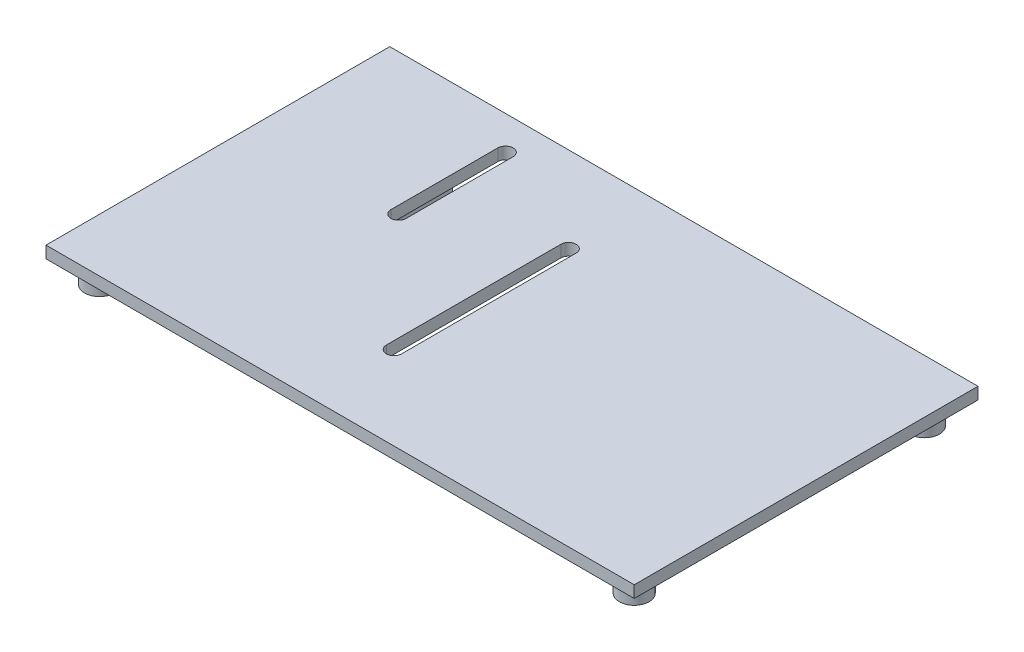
ISO-10303-21;
HEADER;
FILE_DESCRIPTION(('STEP AP214'),'2;1');
FILE_NAME('part.step','',(''),(''),'','','');
FILE_SCHEMA(('AUTOMOTIVE_DESIGN { 1 0 10303 214 1 1 1 1 }'));
ENDSEC;
DATA;
#1=APPLICATION_CONTEXT('core data for automotive mechanical design processes');
#2=APPLICATION_PROTOCOL_DEFINITION('international standard','automotive_design',2000,#1);
#3=PRODUCT_CONTEXT('',#1,'mechanical');
#4=PRODUCT('Part','Part','',(#3));
#5=PRODUCT_RELATED_PRODUCT_CATEGORY('part','',(#4));
#6=PRODUCT_DEFINITION_FORMATION('','',#4);
#7=PRODUCT_DEFINITION_CONTEXT('part definition',#1,'design');
#8=PRODUCT_DEFINITION('design','',#6,#7);
#9=PRODUCT_DEFINITION_SHAPE('','',#8);
#10=(LENGTH_UNIT() NAMED_UNIT(*) SI_UNIT(.MILLI.,.METRE.));
#11=(NAMED_UNIT(*) PLANE_ANGLE_UNIT() SI_UNIT($,.RADIAN.));
#12=(NAMED_UNIT(*) SI_UNIT($,.STERADIAN.) SOLID_ANGLE_UNIT());
#13=UNCERTAINTY_MEASURE_WITH_UNIT(LENGTH_MEASURE(1.E-05),#10,'distance_accuracy_value','');
#14=(GEOMETRIC_REPRESENTATION_CONTEXT(3) GLOBAL_UNCERTAINTY_ASSIGNED_CONTEXT((#13)) GLOBAL_UNIT_ASSIGNED_CONTEXT((#10,
#11,#12)) REPRESENTATION_CONTEXT('',''));
#15=CARTESIAN_POINT('',(0.,0.,0.));
#16=DIRECTION('',(0.,0.,1.));
#17=DIRECTION('',(1.,0.,0.));
#18=AXIS2_PLACEMENT_3D('',#15,#16,#17);
#19=CARTESIAN_POINT('',(0.,0.,0.));
#20=DIRECTION('',(0.,-1.,0.));
#21=DIRECTION('',(0.,0.,-1.));
#22=AXIS2_PLACEMENT_3D('',#19,#20,#21);
#23=PLANE('',#22);
#24=CARTESIAN_POINT('',(-3.9,0.,11.55));
#25=DIRECTION('',(0.,-1.,0.));
#26=DIRECTION('',(0.,0.,-1.));
#27=AXIS2_PLACEMENT_3D('',#24,#25,#26);
#28=CIRCLE('',#27,0.999999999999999);
#29=CARTESIAN_POINT('',(-2.9,0.,11.55));
#30=VERTEX_POINT('',#29);
#31=CARTESIAN_POINT('',(-4.89999999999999,0.,11.55));
#32=VERTEX_POINT('',#31);
#33=EDGE_CURVE('E50',#30,#32,#28,.T.);
#34=ORIENTED_EDGE('',*,*,#33,.F.);
#35=DIRECTION('',(0.,0.,1.));
#36=VECTOR('',#35,1.);
#37=CARTESIAN_POINT('',(-2.9,0.,11.55));
#38=LINE('',#37,#36);
#39=CARTESIAN_POINT('',(-2.89999999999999,0.,-11.3));
#40=VERTEX_POINT('',#39);
#41=EDGE_CURVE('E243',#40,#30,#38,.T.);
#42=ORIENTED_EDGE('',*,*,#41,.F.);
#43=CARTESIAN_POINT('',(-3.89999999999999,0.,-11.3));
#44=DIRECTION('',(0.,-1.,0.));
#45=DIRECTION('',(0.,0.,-1.));
#46=AXIS2_PLACEMENT_3D('',#43,#44,#45);
#47=CIRCLE('',#46,0.999999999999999);
#48=CARTESIAN_POINT('',(-4.89999999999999,0.,-11.3));
#49=VERTEX_POINT('',#48);
#50=EDGE_CURVE('E255',#49,#40,#47,.T.);
#51=ORIENTED_EDGE('',*,*,#50,.F.);
#52=DIRECTION('',(0.,0.,-1.));
#53=VECTOR('',#52,1.);
#54=CARTESIAN_POINT('',(-4.89999999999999,0.,11.55));
#55=LINE('',#54,#53);
#56=EDGE_CURVE('E252',#32,#49,#55,.T.);
#57=ORIENTED_EDGE('',*,*,#56,.F.);
#58=EDGE_LOOP('',(#34,#42,#51,#57));
#59=FACE_BOUND('',#58,.T.);
#60=CARTESIAN_POINT('',(-18.95,0.,-4.1));
#61=DIRECTION('',(0.,-1.,0.));
#62=DIRECTION('',(0.,0.,-1.));
#63=AXIS2_PLACEMENT_3D('',#60,#61,#62);
#64=CIRCLE('',#63,0.999999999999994);
#65=CARTESIAN_POINT('',(-17.95,0.,-4.1));
#66=VERTEX_POINT('',#65);
#67=CARTESIAN_POINT('',(-19.95,0.,-4.1));
#68=VERTEX_POINT('',#67);
#69=EDGE_CURVE('E262',#66,#68,#64,.T.);
#70=ORIENTED_EDGE('',*,*,#69,.F.);
#71=DIRECTION('',(0.,0.,1.));
#72=VECTOR('',#71,1.);
#73=CARTESIAN_POINT('',(-17.95,0.,-4.1));
#74=LINE('',#73,#72);
#75=CARTESIAN_POINT('',(-17.95,0.,-18.1));
#76=VERTEX_POINT('',#75);
#77=EDGE_CURVE('E272',#76,#66,#74,.T.);
#78=ORIENTED_EDGE('',*,*,#77,.F.);
#79=CARTESIAN_POINT('',(-18.95,0.,-18.1));
#80=DIRECTION('',(0.,-1.,0.));
#81=DIRECTION('',(0.,0.,-1.));
#82=AXIS2_PLACEMENT_3D('',#79,#80,#81);
#83=CIRCLE('',#82,0.999999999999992);
#84=CARTESIAN_POINT('',(-19.95,0.,-18.1));
#85=VERTEX_POINT('',#84);
#86=EDGE_CURVE('E286',#85,#76,#83,.T.);
#87=ORIENTED_EDGE('',*,*,#86,.F.);
#88=DIRECTION('',(0.,0.,-1.));
#89=VECTOR('',#88,1.);
#90=CARTESIAN_POINT('',(-19.95,0.,-4.1));
#91=LINE('',#90,#89);
#92=EDGE_CURVE('E283',#68,#85,#91,.T.);
#93=ORIENTED_EDGE('',*,*,#92,.F.);
#94=EDGE_LOOP('',(#70,#78,#87,#93));
#95=FACE_BOUND('',#94,.T.);
#96=CARTESIAN_POINT('',(35.,0.,-19.));
#97=DIRECTION('',(0.,-1.,0.));
#98=DIRECTION('',(0.,0.,-1.));
#99=AXIS2_PLACEMENT_3D('',#96,#97,#98);
#100=CIRCLE('',#99,3.);
#101=CARTESIAN_POINT('',(35.,0.,-22.));
#102=VERTEX_POINT('',#101);
#103=EDGE_CURVE('E408',#102,#102,#100,.T.);
#104=ORIENTED_EDGE('',*,*,#103,.F.);
#105=EDGE_LOOP('',(#104));
#106=FACE_BOUND('',#105,.T.);
#107=CARTESIAN_POINT('',(-35.,0.,-19.));
#108=DIRECTION('',(0.,-1.,0.));
#109=DIRECTION('',(0.,0.,-1.));
#110=AXIS2_PLACEMENT_3D('',#107,#108,#109);
#111=CIRCLE('',#110,3.);
#112=CARTESIAN_POINT('',(-35.,0.,-22.));
#113=VERTEX_POINT('',#112);
#114=EDGE_CURVE('E414',#113,#113,#111,.T.);
#115=ORIENTED_EDGE('',*,*,#114,.F.);
#116=EDGE_LOOP('',(#115));
#117=FACE_BOUND('',#116,.T.);
#118=CARTESIAN_POINT('',(35.,0.,19.));
#119=DIRECTION('',(0.,-1.,0.));
#120=DIRECTION('',(0.,0.,-1.));
#121=AXIS2_PLACEMENT_3D('',#118,#119,#120);
#122=CIRCLE('',#121,3.);
#123=CARTESIAN_POINT('',(35.,0.,16.));
#124=VERTEX_POINT('',#123);
#125=EDGE_CURVE('E420',#124,#124,#122,.T.);
#126=ORIENTED_EDGE('',*,*,#125,.F.);
#127=EDGE_LOOP('',(#126));
#128=FACE_BOUND('',#127,.T.);
#129=CARTESIAN_POINT('',(-35.,0.,19.));
#130=DIRECTION('',(0.,-1.,0.));
#131=DIRECTION('',(0.,0.,-1.));
#132=AXIS2_PLACEMENT_3D('',#129,#130,#131);
#133=CIRCLE('',#132,3.);
#134=CARTESIAN_POINT('',(-35.,0.,16.));
#135=VERTEX_POINT('',#134);
#136=EDGE_CURVE('E426',#135,#135,#133,.T.);
#137=ORIENTED_EDGE('',*,*,#136,.F.);
#138=EDGE_LOOP('',(#137));
#139=FACE_BOUND('',#138,.T.);
#140=DIRECTION('',(0.,0.,-1.));
#141=VECTOR('',#140,1.);
#142=CARTESIAN_POINT('',(38.5,0.,22.5));
#143=LINE('',#142,#141);
#144=CARTESIAN_POINT('',(38.5,0.,22.5));
#145=VERTEX_POINT('',#144);
#146=CARTESIAN_POINT('',(38.5,0.,-22.5));
#147=VERTEX_POINT('',#146);
#148=EDGE_CURVE('E432',#145,#147,#143,.T.);
#149=ORIENTED_EDGE('',*,*,#148,.F.);
#150=DIRECTION('',(1.,0.,0.));
#151=VECTOR('',#150,1.);
#152=CARTESIAN_POINT('',(-38.5,0.,22.5));
#153=LINE('',#152,#151);
#154=CARTESIAN_POINT('',(-38.5,0.,22.5));
#155=VERTEX_POINT('',#154);
#156=EDGE_CURVE('E439',#155,#145,#153,.T.);
#157=ORIENTED_EDGE('',*,*,#156,.F.);
#158=DIRECTION('',(0.,0.,1.));
#159=VECTOR('',#158,1.);
#160=CARTESIAN_POINT('',(-38.5,0.,22.5));
#161=LINE('',#160,#159);
#162=CARTESIAN_POINT('',(-38.5,0.,-22.5));
#163=VERTEX_POINT('',#162);
#164=EDGE_CURVE('E450',#163,#155,#161,.T.);
#165=ORIENTED_EDGE('',*,*,#164,.F.);
#166=DIRECTION('',(-1.,0.,0.));
#167=VECTOR('',#166,1.);
#168=CARTESIAN_POINT('',(-38.5,0.,-22.5));
#169=LINE('',#168,#167);
#170=EDGE_CURVE('E448',#147,#163,#169,.T.);
#171=ORIENTED_EDGE('',*,*,#170,.F.);
#172=EDGE_LOOP('',(#149,#157,#165,#171));
#173=FACE_BOUND('',#172,.T.);
#174=DIRECTION('',(1.,0.,0.));
#175=VECTOR('',#174,1.);
#176=CARTESIAN_POINT('',(-25.,0.,-12.5));
#177=LINE('',#176,#175);
#178=CARTESIAN_POINT('',(-25.,0.,-12.5));
#179=VERTEX_POINT('',#178);
#180=CARTESIAN_POINT('',(-20.3,0.,-12.5));
#181=VERTEX_POINT('',#180);
#182=EDGE_CURVE('E371',#179,#181,#177,.T.);
#183=ORIENTED_EDGE('',*,*,#182,.F.);
#184=DIRECTION('',(0.,0.,-1.));
#185=VECTOR('',#184,1.);
#186=CARTESIAN_POINT('',(-25.,0.,13.));
#187=LINE('',#186,#185);
#188=CARTESIAN_POINT('',(-25.,0.,13.));
#189=VERTEX_POINT('',#188);
#190=EDGE_CURVE('E357',#189,#179,#187,.T.);
#191=ORIENTED_EDGE('',*,*,#190,.F.);
#192=DIRECTION('',(-1.,0.,0.));
#193=VECTOR('',#192,1.);
#194=CARTESIAN_POINT('',(-25.,0.,13.));
#195=LINE('',#194,#193);
#196=CARTESIAN_POINT('',(-20.3,0.,13.));
#197=VERTEX_POINT('',#196);
#198=EDGE_CURVE('E362',#197,#189,#195,.T.);
#199=ORIENTED_EDGE('',*,*,#198,.F.);
#200=DIRECTION('',(0.,0.,1.));
#201=VECTOR('',#200,1.);
#202=CARTESIAN_POINT('',(-20.3,0.,13.));
#203=LINE('',#202,#201);
#204=EDGE_CURVE('E373',#181,#197,#203,.T.);
#205=ORIENTED_EDGE('',*,*,#204,.F.);
#206=EDGE_LOOP('',(#183,#191,#199,#205));
#207=FACE_BOUND('',#206,.T.);
#208=DIRECTION('',(1.,0.,0.));
#209=VECTOR('',#208,1.);
#210=CARTESIAN_POINT('',(12.25,0.,-19.65));
#211=LINE('',#210,#209);
#212=CARTESIAN_POINT('',(12.25,0.,-19.65));
#213=VERTEX_POINT('',#212);
#214=CARTESIAN_POINT('',(17.,0.,-19.65));
#215=VERTEX_POINT('',#214);
#216=EDGE_CURVE('E342',#213,#215,#211,.T.);
#217=ORIENTED_EDGE('',*,*,#216,.F.);
#218=DIRECTION('',(0.,0.,-1.));
#219=VECTOR('',#218,1.);
#220=CARTESIAN_POINT('',(12.25,0.,-12.6));
#221=LINE('',#220,#219);
#222=CARTESIAN_POINT('',(12.25,0.,-12.6));
#223=VERTEX_POINT('',#222);
#224=EDGE_CURVE('E328',#223,#213,#221,.T.);
#225=ORIENTED_EDGE('',*,*,#224,.F.);
#226=DIRECTION('',(-1.,0.,0.));
#227=VECTOR('',#226,1.);
#228=CARTESIAN_POINT('',(12.25,0.,-12.6));
#229=LINE('',#228,#227);
#230=CARTESIAN_POINT('',(17.,0.,-12.6));
#231=VERTEX_POINT('',#230);
#232=EDGE_CURVE('E333',#231,#223,#229,.T.);
#233=ORIENTED_EDGE('',*,*,#232,.F.);
#234=DIRECTION('',(0.,0.,1.));
#235=VECTOR('',#234,1.);
#236=CARTESIAN_POINT('',(17.,0.,-12.6));
#237=LINE('',#236,#235);
#238=EDGE_CURVE('E344',#215,#231,#237,.T.);
#239=ORIENTED_EDGE('',*,*,#238,.F.);
#240=EDGE_LOOP('',(#217,#225,#233,#239));
#241=FACE_BOUND('',#240,.T.);
#242=DIRECTION('',(1.,0.,0.));
#243=VECTOR('',#242,1.);
#244=CARTESIAN_POINT('',(24.,0.,-9.75));
#245=LINE('',#244,#243);
#246=CARTESIAN_POINT('',(24.,0.,-9.75));
#247=VERTEX_POINT('',#246);
#248=CARTESIAN_POINT('',(29.5,0.,-9.75));
#249=VERTEX_POINT('',#248);
#250=EDGE_CURVE('E313',#247,#249,#245,.T.);
#251=ORIENTED_EDGE('',*,*,#250,.F.);
#252=DIRECTION('',(0.,0.,-1.));
#253=VECTOR('',#252,1.);
#254=CARTESIAN_POINT('',(24.,0.,9.75));
#255=LINE('',#254,#253);
#256=CARTESIAN_POINT('',(24.,0.,9.75));
#257=VERTEX_POINT('',#256);
#258=EDGE_CURVE('E293',#257,#247,#255,.T.);
#259=ORIENTED_EDGE('',*,*,#258,.F.);
#260=DIRECTION('',(-1.,0.,0.));
#261=VECTOR('',#260,1.);
#262=CARTESIAN_POINT('',(24.,0.,9.75));
#263=LINE('',#262,#261);
#264=CARTESIAN_POINT('',(29.5,0.,9.75));
#265=VERTEX_POINT('',#264);
#266=EDGE_CURVE('E304',#265,#257,#263,.T.);
#267=ORIENTED_EDGE('',*,*,#266,.F.);
#268=DIRECTION('',(0.,0.,1.));
#269=VECTOR('',#268,1.);
#270=CARTESIAN_POINT('',(29.5,0.,9.75));
#271=LINE('',#270,#269);
#272=EDGE_CURVE('E315',#249,#265,#271,.T.);
#273=ORIENTED_EDGE('',*,*,#272,.F.);
#274=EDGE_LOOP('',(#251,#259,#267,#273));
#275=FACE_BOUND('',#274,.T.);
#276=ADVANCED_FACE('F35',(#59,#95,#106,#117,#128,#139,#173,#207,#241,#275),#23,.T.);
#277=CARTESIAN_POINT('',(38.5,1.56,22.5));
#278=DIRECTION('',(-1.,0.,0.));
#279=DIRECTION('',(0.,0.,1.));
#280=AXIS2_PLACEMENT_3D('',#277,#278,#279);
#281=PLANE('',#280);
#282=ORIENTED_EDGE('',*,*,#148,.T.);
#283=DIRECTION('',(0.,-1.,0.));
#284=VECTOR('',#283,1.);
#285=CARTESIAN_POINT('',(38.5,1.56,-22.5));
#286=LINE('',#285,#284);
#287=CARTESIAN_POINT('',(38.5,1.56,-22.5));
#288=VERTEX_POINT('',#287);
#289=EDGE_CURVE('E11',#288,#147,#286,.T.);
#290=ORIENTED_EDGE('',*,*,#289,.F.);
#291=DIRECTION('',(0.,0.,-1.));
#292=VECTOR('',#291,1.);
#293=CARTESIAN_POINT('',(38.5,1.56,22.5));
#294=LINE('',#293,#292);
#295=CARTESIAN_POINT('',(38.5,1.56,22.5));
#296=VERTEX_POINT('',#295);
#297=EDGE_CURVE('E435',#296,#288,#294,.T.);
#298=ORIENTED_EDGE('',*,*,#297,.F.);
#299=DIRECTION('',(0.,-1.,0.));
#300=VECTOR('',#299,1.);
#301=CARTESIAN_POINT('',(38.5,1.56,22.5));
#302=LINE('',#301,#300);
#303=EDGE_CURVE('E445',#296,#145,#302,.T.);
#304=ORIENTED_EDGE('',*,*,#303,.T.);
#305=EDGE_LOOP('',(#282,#290,#298,#304));
#306=FACE_BOUND('',#305,.T.);
#307=ADVANCED_FACE('F37',(#306),#281,.F.);
#308=CARTESIAN_POINT('',(-38.5,1.56,-22.5));
#309=DIRECTION('',(0.,0.,1.));
#310=DIRECTION('',(1.,0.,0.));
#311=AXIS2_PLACEMENT_3D('',#308,#309,#310);
#312=PLANE('',#311);
#313=ORIENTED_EDGE('',*,*,#170,.T.);
#314=DIRECTION('',(0.,-1.,0.));
#315=VECTOR('',#314,1.);
#316=CARTESIAN_POINT('',(-38.5,1.56,-22.5));
#317=LINE('',#316,#315);
#318=CARTESIAN_POINT('',(-38.5,1.56,-22.5));
#319=VERTEX_POINT('',#318);
#320=EDGE_CURVE('E43',#319,#163,#317,.T.);
#321=ORIENTED_EDGE('',*,*,#320,.F.);
#322=DIRECTION('',(-1.,0.,0.));
#323=VECTOR('',#322,1.);
#324=CARTESIAN_POINT('',(-38.5,1.56,-22.5));
#325=LINE('',#324,#323);
#326=EDGE_CURVE('E438',#288,#319,#325,.T.);
#327=ORIENTED_EDGE('',*,*,#326,.F.);
#328=ORIENTED_EDGE('',*,*,#289,.T.);
#329=EDGE_LOOP('',(#313,#321,#327,#328));
#330=FACE_BOUND('',#329,.T.);
#331=ADVANCED_FACE('F478',(#330),#312,.F.);
#332=CARTESIAN_POINT('',(-38.5,1.56,22.5));
#333=DIRECTION('',(1.,0.,0.));
#334=DIRECTION('',(0.,0.,-1.));
#335=AXIS2_PLACEMENT_3D('',#332,#333,#334);
#336=PLANE('',#335);
#337=ORIENTED_EDGE('',*,*,#164,.T.);
#338=DIRECTION('',(0.,-1.,0.));
#339=VECTOR('',#338,1.);
#340=CARTESIAN_POINT('',(-38.5,1.56,22.5));
#341=LINE('',#340,#339);
#342=CARTESIAN_POINT('',(-38.5,1.56,22.5));
#343=VERTEX_POINT('',#342);
#344=EDGE_CURVE('E455',#343,#155,#341,.T.);
#345=ORIENTED_EDGE('',*,*,#344,.F.);
#346=DIRECTION('',(0.,0.,1.));
#347=VECTOR('',#346,1.);
#348=CARTESIAN_POINT('',(-38.5,1.56,22.5));
#349=LINE('',#348,#347);
#350=EDGE_CURVE('E441',#319,#343,#349,.T.);
#351=ORIENTED_EDGE('',*,*,#350,.F.);
#352=ORIENTED_EDGE('',*,*,#320,.T.);
#353=EDGE_LOOP('',(#337,#345,#351,#352));
#354=FACE_BOUND('',#353,.T.);
#355=ADVANCED_FACE('F462',(#354),#336,.F.);
#356=CARTESIAN_POINT('',(-38.5,1.56,22.5));
#357=DIRECTION('',(0.,0.,-1.));
#358=DIRECTION('',(-1.,0.,0.));
#359=AXIS2_PLACEMENT_3D('',#356,#357,#358);
#360=PLANE('',#359);
#361=ORIENTED_EDGE('',*,*,#156,.T.);
#362=ORIENTED_EDGE('',*,*,#303,.F.);
#363=DIRECTION('',(1.,0.,0.));
#364=VECTOR('',#363,1.);
#365=CARTESIAN_POINT('',(-38.5,1.56,22.5));
#366=LINE('',#365,#364);
#367=EDGE_CURVE('E443',#343,#296,#366,.T.);
#368=ORIENTED_EDGE('',*,*,#367,.F.);
#369=ORIENTED_EDGE('',*,*,#344,.T.);
#370=EDGE_LOOP('',(#361,#362,#368,#369));
#371=FACE_BOUND('',#370,.T.);
#372=ADVANCED_FACE('F471',(#371),#360,.F.);
#373=CARTESIAN_POINT('',(0.,1.56,0.));
#374=DIRECTION('',(0.,-1.,0.));
#375=DIRECTION('',(0.,0.,-1.));
#376=AXIS2_PLACEMENT_3D('',#373,#374,#375);
#377=PLANE('',#376);
#378=DIRECTION('',(0.,0.,1.));
#379=VECTOR('',#378,1.);
#380=CARTESIAN_POINT('',(-2.9,1.56,11.55));
#381=LINE('',#380,#379);
#382=CARTESIAN_POINT('',(-2.89999999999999,1.56,-11.3));
#383=VERTEX_POINT('',#382);
#384=CARTESIAN_POINT('',(-2.9,1.56,11.55));
#385=VERTEX_POINT('',#384);
#386=EDGE_CURVE('E247',#383,#385,#381,.T.);
#387=ORIENTED_EDGE('',*,*,#386,.T.);
#388=CARTESIAN_POINT('',(-3.9,1.56,11.55));
#389=DIRECTION('',(0.,-1.,0.));
#390=DIRECTION('',(0.,0.,-1.));
#391=AXIS2_PLACEMENT_3D('',#388,#389,#390);
#392=CIRCLE('',#391,0.999999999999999);
#393=CARTESIAN_POINT('',(-4.89999999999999,1.56,11.55));
#394=VERTEX_POINT('',#393);
#395=EDGE_CURVE('E239',#385,#394,#392,.T.);
#396=ORIENTED_EDGE('',*,*,#395,.T.);
#397=DIRECTION('',(0.,0.,-1.));
#398=VECTOR('',#397,1.);
#399=CARTESIAN_POINT('',(-4.89999999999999,1.56,11.55));
#400=LINE('',#399,#398);
#401=CARTESIAN_POINT('',(-4.89999999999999,1.56,-11.3));
#402=VERTEX_POINT('',#401);
#403=EDGE_CURVE('E242',#394,#402,#400,.T.);
#404=ORIENTED_EDGE('',*,*,#403,.T.);
#405=CARTESIAN_POINT('',(-3.89999999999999,1.56,-11.3));
#406=DIRECTION('',(0.,-1.,0.));
#407=DIRECTION('',(0.,0.,-1.));
#408=AXIS2_PLACEMENT_3D('',#405,#406,#407);
#409=CIRCLE('',#408,0.999999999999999);
#410=EDGE_CURVE('E58',#402,#383,#409,.T.);
#411=ORIENTED_EDGE('',*,*,#410,.T.);
#412=EDGE_LOOP('',(#387,#396,#404,#411));
#413=FACE_BOUND('',#412,.T.);
#414=DIRECTION('',(0.,0.,1.));
#415=VECTOR('',#414,1.);
#416=CARTESIAN_POINT('',(-17.95,1.56,-4.1));
#417=LINE('',#416,#415);
#418=CARTESIAN_POINT('',(-17.95,1.56,-18.1));
#419=VERTEX_POINT('',#418);
#420=CARTESIAN_POINT('',(-17.95,1.56,-4.1));
#421=VERTEX_POINT('',#420);
#422=EDGE_CURVE('E278',#419,#421,#417,.T.);
#423=ORIENTED_EDGE('',*,*,#422,.T.);
#424=CARTESIAN_POINT('',(-18.95,1.56,-4.1));
#425=DIRECTION('',(0.,-1.,0.));
#426=DIRECTION('',(0.,0.,-1.));
#427=AXIS2_PLACEMENT_3D('',#424,#425,#426);
#428=CIRCLE('',#427,0.999999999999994);
#429=CARTESIAN_POINT('',(-19.95,1.56,-4.1));
#430=VERTEX_POINT('',#429);
#431=EDGE_CURVE('E268',#421,#430,#428,.T.);
#432=ORIENTED_EDGE('',*,*,#431,.T.);
#433=DIRECTION('',(0.,0.,-1.));
#434=VECTOR('',#433,1.);
#435=CARTESIAN_POINT('',(-19.95,1.56,-4.1));
#436=LINE('',#435,#434);
#437=CARTESIAN_POINT('',(-19.95,1.56,-18.1));
#438=VERTEX_POINT('',#437);
#439=EDGE_CURVE('E271',#430,#438,#436,.T.);
#440=ORIENTED_EDGE('',*,*,#439,.T.);
#441=CARTESIAN_POINT('',(-18.95,1.56,-18.1));
#442=DIRECTION('',(0.,-1.,0.));
#443=DIRECTION('',(0.,0.,-1.));
#444=AXIS2_PLACEMENT_3D('',#441,#442,#443);
#445=CIRCLE('',#444,0.999999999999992);
#446=EDGE_CURVE('E275',#438,#419,#445,.T.);
#447=ORIENTED_EDGE('',*,*,#446,.T.);
#448=EDGE_LOOP('',(#423,#432,#440,#447));
#449=FACE_BOUND('',#448,.T.);
#450=ORIENTED_EDGE('',*,*,#297,.T.);
#451=ORIENTED_EDGE('',*,*,#326,.T.);
#452=ORIENTED_EDGE('',*,*,#350,.T.);
#453=ORIENTED_EDGE('',*,*,#367,.T.);
#454=EDGE_LOOP('',(#450,#451,#452,#453));
#455=FACE_BOUND('',#454,.T.);
#456=ADVANCED_FACE('F477',(#413,#449,#455),#377,.F.);
#457=CARTESIAN_POINT('',(-35.,-0.5,19.));
#458=DIRECTION('',(0.,1.,0.));
#459=DIRECTION('',(0.,0.,1.));
#460=AXIS2_PLACEMENT_3D('',#457,#458,#459);
#461=CYLINDRICAL_SURFACE('',#460,3.);
#462=CARTESIAN_POINT('',(-35.,-0.5,19.));
#463=DIRECTION('',(0.,-1.,0.));
#464=DIRECTION('',(0.,0.,-1.));
#465=AXIS2_PLACEMENT_3D('',#462,#463,#464);
#466=CIRCLE('',#465,3.);
#467=CARTESIAN_POINT('',(-35.,-0.5,16.));
#468=VERTEX_POINT('',#467);
#469=EDGE_CURVE('E429',#468,#468,#466,.T.);
#470=ORIENTED_EDGE('',*,*,#469,.F.);
#471=EDGE_LOOP('',(#470));
#472=FACE_BOUND('',#471,.T.);
#473=ORIENTED_EDGE('',*,*,#136,.T.);
#474=EDGE_LOOP('',(#473));
#475=FACE_BOUND('',#474,.T.);
#476=ADVANCED_FACE('F498',(#472,#475),#461,.T.);
#477=CARTESIAN_POINT('',(-35.,-0.5,19.));
#478=DIRECTION('',(0.,-1.,0.));
#479=DIRECTION('',(0.,0.,-1.));
#480=AXIS2_PLACEMENT_3D('',#477,#478,#479);
#481=PLANE('',#480);
#482=CARTESIAN_POINT('',(-35.,-0.5,19.));
#483=DIRECTION('',(0.,-1.,0.));
#484=DIRECTION('',(0.,0.,-1.));
#485=AXIS2_PLACEMENT_3D('',#482,#483,#484);
#486=CIRCLE('',#485,1.95);
#487=CARTESIAN_POINT('',(-35.,-0.5,17.05));
#488=VERTEX_POINT('',#487);
#489=EDGE_CURVE('E402',#488,#488,#486,.T.);
#490=ORIENTED_EDGE('',*,*,#489,.F.);
#491=EDGE_LOOP('',(#490));
#492=FACE_BOUND('',#491,.T.);
#493=ORIENTED_EDGE('',*,*,#469,.T.);
#494=EDGE_LOOP('',(#493));
#495=FACE_BOUND('',#494,.T.);
#496=ADVANCED_FACE('F503',(#492,#495),#481,.T.);
#497=CARTESIAN_POINT('',(35.,-0.5,19.));
#498=DIRECTION('',(0.,1.,0.));
#499=DIRECTION('',(0.,0.,1.));
#500=AXIS2_PLACEMENT_3D('',#497,#498,#499);
#501=CYLINDRICAL_SURFACE('',#500,3.);
#502=CARTESIAN_POINT('',(35.,-0.5,19.));
#503=DIRECTION('',(0.,-1.,0.));
#504=DIRECTION('',(0.,0.,-1.));
#505=AXIS2_PLACEMENT_3D('',#502,#503,#504);
#506=CIRCLE('',#505,3.);
#507=CARTESIAN_POINT('',(35.,-0.5,16.));
#508=VERTEX_POINT('',#507);
#509=EDGE_CURVE('E423',#508,#508,#506,.T.);
#510=ORIENTED_EDGE('',*,*,#509,.F.);
#511=EDGE_LOOP('',(#510));
#512=FACE_BOUND('',#511,.T.);
#513=ORIENTED_EDGE('',*,*,#125,.T.);
#514=EDGE_LOOP('',(#513));
#515=FACE_BOUND('',#514,.T.);
#516=ADVANCED_FACE('F533',(#512,#515),#501,.T.);
#517=CARTESIAN_POINT('',(35.,-0.5,19.));
#518=DIRECTION('',(0.,-1.,0.));
#519=DIRECTION('',(0.,0.,-1.));
#520=AXIS2_PLACEMENT_3D('',#517,#518,#519);
#521=PLANE('',#520);
#522=CARTESIAN_POINT('',(35.,-0.5,19.));
#523=DIRECTION('',(0.,-1.,0.));
#524=DIRECTION('',(0.,0.,-1.));
#525=AXIS2_PLACEMENT_3D('',#522,#523,#524);
#526=CIRCLE('',#525,1.95);
#527=CARTESIAN_POINT('',(35.,-0.5,17.05));
#528=VERTEX_POINT('',#527);
#529=EDGE_CURVE('E386',#528,#528,#526,.T.);
#530=ORIENTED_EDGE('',*,*,#529,.F.);
#531=EDGE_LOOP('',(#530));
#532=FACE_BOUND('',#531,.T.);
#533=ORIENTED_EDGE('',*,*,#509,.T.);
#534=EDGE_LOOP('',(#533));
#535=FACE_BOUND('',#534,.T.);
#536=ADVANCED_FACE('F535',(#532,#535),#521,.T.);
#537=CARTESIAN_POINT('',(-35.,-0.5,-19.));
#538=DIRECTION('',(0.,1.,0.));
#539=DIRECTION('',(0.,0.,1.));
#540=AXIS2_PLACEMENT_3D('',#537,#538,#539);
#541=CYLINDRICAL_SURFACE('',#540,3.);
#542=CARTESIAN_POINT('',(-35.,-0.5,-19.));
#543=DIRECTION('',(0.,-1.,0.));
#544=DIRECTION('',(0.,0.,-1.));
#545=AXIS2_PLACEMENT_3D('',#542,#543,#544);
#546=CIRCLE('',#545,3.);
#547=CARTESIAN_POINT('',(-35.,-0.5,-22.));
#548=VERTEX_POINT('',#547);
#549=EDGE_CURVE('E417',#548,#548,#546,.T.);
#550=ORIENTED_EDGE('',*,*,#549,.F.);
#551=EDGE_LOOP('',(#550));
#552=FACE_BOUND('',#551,.T.);
#553=ORIENTED_EDGE('',*,*,#114,.T.);
#554=EDGE_LOOP('',(#553));
#555=FACE_BOUND('',#554,.T.);
#556=ADVANCED_FACE('F542',(#552,#555),#541,.T.);
#557=CARTESIAN_POINT('',(-35.,-0.5,-19.));
#558=DIRECTION('',(0.,-1.,0.));
#559=DIRECTION('',(0.,0.,-1.));
#560=AXIS2_PLACEMENT_3D('',#557,#558,#559);
#561=PLANE('',#560);
#562=CARTESIAN_POINT('',(-35.,-0.5,-19.));
#563=DIRECTION('',(0.,-1.,0.));
#564=DIRECTION('',(0.,0.,-1.));
#565=AXIS2_PLACEMENT_3D('',#562,#563,#564);
#566=CIRCLE('',#565,1.95);
#567=CARTESIAN_POINT('',(-35.,-0.5,-20.95));
#568=VERTEX_POINT('',#567);
#569=EDGE_CURVE('E396',#568,#568,#566,.T.);
#570=ORIENTED_EDGE('',*,*,#569,.F.);
#571=EDGE_LOOP('',(#570));
#572=FACE_BOUND('',#571,.T.);
#573=ORIENTED_EDGE('',*,*,#549,.T.);
#574=EDGE_LOOP('',(#573));
#575=FACE_BOUND('',#574,.T.);
#576=ADVANCED_FACE('F551',(#572,#575),#561,.T.);
#577=CARTESIAN_POINT('',(35.,-0.5,-19.));
#578=DIRECTION('',(0.,1.,0.));
#579=DIRECTION('',(0.,0.,1.));
#580=AXIS2_PLACEMENT_3D('',#577,#578,#579);
#581=CYLINDRICAL_SURFACE('',#580,3.);
#582=CARTESIAN_POINT('',(35.,-0.5,-19.));
#583=DIRECTION('',(0.,-1.,0.));
#584=DIRECTION('',(0.,0.,-1.));
#585=AXIS2_PLACEMENT_3D('',#582,#583,#584);
#586=CIRCLE('',#585,3.);
#587=CARTESIAN_POINT('',(35.,-0.5,-22.));
#588=VERTEX_POINT('',#587);
#589=EDGE_CURVE('E411',#588,#588,#586,.T.);
#590=ORIENTED_EDGE('',*,*,#589,.F.);
#591=EDGE_LOOP('',(#590));
#592=FACE_BOUND('',#591,.T.);
#593=ORIENTED_EDGE('',*,*,#103,.T.);
#594=EDGE_LOOP('',(#593));
#595=FACE_BOUND('',#594,.T.);
#596=ADVANCED_FACE('F555',(#592,#595),#581,.T.);
#597=CARTESIAN_POINT('',(35.,-0.5,-19.));
#598=DIRECTION('',(0.,-1.,0.));
#599=DIRECTION('',(0.,0.,-1.));
#600=AXIS2_PLACEMENT_3D('',#597,#598,#599);
#601=PLANE('',#600);
#602=CARTESIAN_POINT('',(35.,-0.5,-19.));
#603=DIRECTION('',(0.,-1.,0.));
#604=DIRECTION('',(0.,0.,-1.));
#605=AXIS2_PLACEMENT_3D('',#602,#603,#604);
#606=CIRCLE('',#605,1.95);
#607=CARTESIAN_POINT('',(35.,-0.5,-20.95));
#608=VERTEX_POINT('',#607);
#609=EDGE_CURVE('E390',#608,#608,#606,.T.);
#610=ORIENTED_EDGE('',*,*,#609,.F.);
#611=EDGE_LOOP('',(#610));
#612=FACE_BOUND('',#611,.T.);
#613=ORIENTED_EDGE('',*,*,#589,.T.);
#614=EDGE_LOOP('',(#613));
#615=FACE_BOUND('',#614,.T.);
#616=ADVANCED_FACE('F559',(#612,#615),#601,.T.);
#617=CARTESIAN_POINT('',(-35.,-2.9,19.));
#618=DIRECTION('',(0.,1.,0.));
#619=DIRECTION('',(0.,0.,1.));
#620=AXIS2_PLACEMENT_3D('',#617,#618,#619);
#621=CYLINDRICAL_SURFACE('',#620,1.95);
#622=CARTESIAN_POINT('',(-35.,-2.9,19.));
#623=DIRECTION('',(0.,-1.,0.));
#624=DIRECTION('',(0.,0.,-1.));
#625=AXIS2_PLACEMENT_3D('',#622,#623,#624);
#626=CIRCLE('',#625,1.95);
#627=CARTESIAN_POINT('',(-35.,-2.9,17.05));
#628=VERTEX_POINT('',#627);
#629=EDGE_CURVE('E405',#628,#628,#626,.T.);
#630=ORIENTED_EDGE('',*,*,#629,.F.);
#631=EDGE_LOOP('',(#630));
#632=FACE_BOUND('',#631,.T.);
#633=ORIENTED_EDGE('',*,*,#489,.T.);
#634=EDGE_LOOP('',(#633));
#635=FACE_BOUND('',#634,.T.);
#636=ADVANCED_FACE('F563',(#632,#635),#621,.T.);
#637=CARTESIAN_POINT('',(-35.,-2.9,19.));
#638=DIRECTION('',(0.,-1.,0.));
#639=DIRECTION('',(0.,0.,-1.));
#640=AXIS2_PLACEMENT_3D('',#637,#638,#639);
#641=PLANE('',#640);
#642=CARTESIAN_POINT('',(-35.,-2.9,19.));
#643=DIRECTION('',(0.,-1.,0.));
#644=DIRECTION('',(0.,0.,-1.));
#645=AXIS2_PLACEMENT_3D('',#642,#643,#644);
#646=CIRCLE('',#645,0.888999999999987);
#647=CARTESIAN_POINT('',(-35.,-2.9,18.111));
#648=VERTEX_POINT('',#647);
#649=EDGE_CURVE('E233',#648,#648,#646,.T.);
#650=ORIENTED_EDGE('',*,*,#649,.F.);
#651=EDGE_LOOP('',(#650));
#652=FACE_BOUND('',#651,.T.);
#653=ORIENTED_EDGE('',*,*,#629,.T.);
#654=EDGE_LOOP('',(#653));
#655=FACE_BOUND('',#654,.T.);
#656=ADVANCED_FACE('F567',(#652,#655),#641,.T.);
#657=CARTESIAN_POINT('',(-35.,-2.9,-19.));
#658=DIRECTION('',(0.,1.,0.));
#659=DIRECTION('',(0.,0.,1.));
#660=AXIS2_PLACEMENT_3D('',#657,#658,#659);
#661=CYLINDRICAL_SURFACE('',#660,1.95);
#662=CARTESIAN_POINT('',(-35.,-2.9,-19.));
#663=DIRECTION('',(0.,-1.,0.));
#664=DIRECTION('',(0.,0.,-1.));
#665=AXIS2_PLACEMENT_3D('',#662,#663,#664);
#666=CIRCLE('',#665,1.95);
#667=CARTESIAN_POINT('',(-35.,-2.9,-20.95));
#668=VERTEX_POINT('',#667);
#669=EDGE_CURVE('E399',#668,#668,#666,.T.);
#670=ORIENTED_EDGE('',*,*,#669,.F.);
#671=EDGE_LOOP('',(#670));
#672=FACE_BOUND('',#671,.T.);
#673=ORIENTED_EDGE('',*,*,#569,.T.);
#674=EDGE_LOOP('',(#673));
#675=FACE_BOUND('',#674,.T.);
#676=ADVANCED_FACE('F571',(#672,#675),#661,.T.);
#677=CARTESIAN_POINT('',(-35.,-2.9,-19.));
#678=DIRECTION('',(0.,-1.,0.));
#679=DIRECTION('',(0.,0.,-1.));
#680=AXIS2_PLACEMENT_3D('',#677,#678,#679);
#681=PLANE('',#680);
#682=CARTESIAN_POINT('',(-35.,-2.9,-19.));
#683=DIRECTION('',(0.,-1.,0.));
#684=DIRECTION('',(0.,0.,-1.));
#685=AXIS2_PLACEMENT_3D('',#682,#683,#684);
#686=CIRCLE('',#685,0.888999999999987);
#687=CARTESIAN_POINT('',(-35.,-2.9,-19.889));
#688=VERTEX_POINT('',#687);
#689=EDGE_CURVE('E227',#688,#688,#686,.T.);
#690=ORIENTED_EDGE('',*,*,#689,.F.);
#691=EDGE_LOOP('',(#690));
#692=FACE_BOUND('',#691,.T.);
#693=ORIENTED_EDGE('',*,*,#669,.T.);
#694=EDGE_LOOP('',(#693));
#695=FACE_BOUND('',#694,.T.);
#696=ADVANCED_FACE('F575',(#692,#695),#681,.T.);
#697=CARTESIAN_POINT('',(35.,-2.9,-19.));
#698=DIRECTION('',(0.,1.,0.));
#699=DIRECTION('',(0.,0.,1.));
#700=AXIS2_PLACEMENT_3D('',#697,#698,#699);
#701=CYLINDRICAL_SURFACE('',#700,1.95);
#702=CARTESIAN_POINT('',(35.,-2.9,-19.));
#703=DIRECTION('',(0.,-1.,0.));
#704=DIRECTION('',(0.,0.,-1.));
#705=AXIS2_PLACEMENT_3D('',#702,#703,#704);
#706=CIRCLE('',#705,1.95);
#707=CARTESIAN_POINT('',(35.,-2.9,-20.95));
#708=VERTEX_POINT('',#707);
#709=EDGE_CURVE('E393',#708,#708,#706,.T.);
#710=ORIENTED_EDGE('',*,*,#709,.F.);
#711=EDGE_LOOP('',(#710));
#712=FACE_BOUND('',#711,.T.);
#713=ORIENTED_EDGE('',*,*,#609,.T.);
#714=EDGE_LOOP('',(#713));
#715=FACE_BOUND('',#714,.T.);
#716=ADVANCED_FACE('F579',(#712,#715),#701,.T.);
#717=CARTESIAN_POINT('',(35.,-2.9,-19.));
#718=DIRECTION('',(0.,-1.,0.));
#719=DIRECTION('',(0.,0.,-1.));
#720=AXIS2_PLACEMENT_3D('',#717,#718,#719);
#721=PLANE('',#720);
#722=CARTESIAN_POINT('',(35.,-2.9,-19.));
#723=DIRECTION('',(0.,-1.,0.));
#724=DIRECTION('',(0.,0.,-1.));
#725=AXIS2_PLACEMENT_3D('',#722,#723,#724);
#726=CIRCLE('',#725,0.888999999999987);
#727=CARTESIAN_POINT('',(35.,-2.9,-19.889));
#728=VERTEX_POINT('',#727);
#729=EDGE_CURVE('E216',#728,#728,#726,.T.);
#730=ORIENTED_EDGE('',*,*,#729,.F.);
#731=EDGE_LOOP('',(#730));
#732=FACE_BOUND('',#731,.T.);
#733=ORIENTED_EDGE('',*,*,#709,.T.);
#734=EDGE_LOOP('',(#733));
#735=FACE_BOUND('',#734,.T.);
#736=ADVANCED_FACE('F583',(#732,#735),#721,.T.);
#737=CARTESIAN_POINT('',(35.,-2.9,19.));
#738=DIRECTION('',(0.,1.,0.));
#739=DIRECTION('',(0.,0.,1.));
#740=AXIS2_PLACEMENT_3D('',#737,#738,#739);
#741=CYLINDRICAL_SURFACE('',#740,1.95);
#742=CARTESIAN_POINT('',(35.,-2.9,19.));
#743=DIRECTION('',(0.,-1.,0.));
#744=DIRECTION('',(0.,0.,-1.));
#745=AXIS2_PLACEMENT_3D('',#742,#743,#744);
#746=CIRCLE('',#745,1.95);
#747=CARTESIAN_POINT('',(35.,-2.9,17.05));
#748=VERTEX_POINT('',#747);
#749=EDGE_CURVE('E387',#748,#748,#746,.T.);
#750=ORIENTED_EDGE('',*,*,#749,.F.);
#751=EDGE_LOOP('',(#750));
#752=FACE_BOUND('',#751,.T.);
#753=ORIENTED_EDGE('',*,*,#529,.T.);
#754=EDGE_LOOP('',(#753));
#755=FACE_BOUND('',#754,.T.);
#756=ADVANCED_FACE('F587',(#752,#755),#741,.T.);
#757=CARTESIAN_POINT('',(35.,-2.9,19.));
#758=DIRECTION('',(0.,-1.,0.));
#759=DIRECTION('',(0.,0.,-1.));
#760=AXIS2_PLACEMENT_3D('',#757,#758,#759);
#761=PLANE('',#760);
#762=CARTESIAN_POINT('',(35.,-2.9,19.));
#763=DIRECTION('',(0.,-1.,0.));
#764=DIRECTION('',(0.,0.,-1.));
#765=AXIS2_PLACEMENT_3D('',#762,#763,#764);
#766=CIRCLE('',#765,0.888999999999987);
#767=CARTESIAN_POINT('',(35.,-2.9,18.111));
#768=VERTEX_POINT('',#767);
#769=EDGE_CURVE('E217',#768,#768,#766,.T.);
#770=ORIENTED_EDGE('',*,*,#769,.F.);
#771=EDGE_LOOP('',(#770));
#772=FACE_BOUND('',#771,.T.);
#773=ORIENTED_EDGE('',*,*,#749,.T.);
#774=EDGE_LOOP('',(#773));
#775=FACE_BOUND('',#774,.T.);
#776=ADVANCED_FACE('F591',(#772,#775),#761,.T.);
#777=CARTESIAN_POINT('',(-25.,-1.25,13.));
#778=DIRECTION('',(1.,0.,0.));
#779=DIRECTION('',(0.,0.,-1.));
#780=AXIS2_PLACEMENT_3D('',#777,#778,#779);
#781=PLANE('',#780);
#782=ORIENTED_EDGE('',*,*,#190,.T.);
#783=DIRECTION('',(0.,1.,0.));
#784=VECTOR('',#783,1.);
#785=CARTESIAN_POINT('',(-25.,-1.25,-12.5));
#786=LINE('',#785,#784);
#787=CARTESIAN_POINT('',(-25.,-1.25,-12.5));
#788=VERTEX_POINT('',#787);
#789=EDGE_CURVE('E384',#788,#179,#786,.T.);
#790=ORIENTED_EDGE('',*,*,#789,.F.);
#791=DIRECTION('',(0.,0.,-1.));
#792=VECTOR('',#791,1.);
#793=CARTESIAN_POINT('',(-25.,-1.25,13.));
#794=LINE('',#793,#792);
#795=CARTESIAN_POINT('',(-25.,-1.25,13.));
#796=VERTEX_POINT('',#795);
#797=EDGE_CURVE('E358',#796,#788,#794,.T.);
#798=ORIENTED_EDGE('',*,*,#797,.F.);
#799=DIRECTION('',(0.,1.,0.));
#800=VECTOR('',#799,1.);
#801=CARTESIAN_POINT('',(-25.,-1.25,13.));
#802=LINE('',#801,#800);
#803=EDGE_CURVE('E368',#796,#189,#802,.T.);
#804=ORIENTED_EDGE('',*,*,#803,.T.);
#805=EDGE_LOOP('',(#782,#790,#798,#804));
#806=FACE_BOUND('',#805,.T.);
#807=ADVANCED_FACE('F595',(#806),#781,.F.);
#808=CARTESIAN_POINT('',(-25.,-1.25,-12.5));
#809=DIRECTION('',(0.,0.,1.));
#810=DIRECTION('',(1.,0.,0.));
#811=AXIS2_PLACEMENT_3D('',#808,#809,#810);
#812=PLANE('',#811);
#813=ORIENTED_EDGE('',*,*,#182,.T.);
#814=DIRECTION('',(0.,1.,0.));
#815=VECTOR('',#814,1.);
#816=CARTESIAN_POINT('',(-20.3,-1.25,-12.5));
#817=LINE('',#816,#815);
#818=CARTESIAN_POINT('',(-20.3,-1.25,-12.5));
#819=VERTEX_POINT('',#818);
#820=EDGE_CURVE('E381',#819,#181,#817,.T.);
#821=ORIENTED_EDGE('',*,*,#820,.F.);
#822=DIRECTION('',(1.,0.,0.));
#823=VECTOR('',#822,1.);
#824=CARTESIAN_POINT('',(-25.,-1.25,-12.5));
#825=LINE('',#824,#823);
#826=EDGE_CURVE('E361',#788,#819,#825,.T.);
#827=ORIENTED_EDGE('',*,*,#826,.F.);
#828=ORIENTED_EDGE('',*,*,#789,.T.);
#829=EDGE_LOOP('',(#813,#821,#827,#828));
#830=FACE_BOUND('',#829,.T.);
#831=ADVANCED_FACE('F599',(#830),#812,.F.);
#832=CARTESIAN_POINT('',(-20.3,-1.25,13.));
#833=DIRECTION('',(-1.,0.,0.));
#834=DIRECTION('',(0.,0.,1.));
#835=AXIS2_PLACEMENT_3D('',#832,#833,#834);
#836=PLANE('',#835);
#837=ORIENTED_EDGE('',*,*,#204,.T.);
#838=DIRECTION('',(0.,1.,0.));
#839=VECTOR('',#838,1.);
#840=CARTESIAN_POINT('',(-20.3,-1.25,13.));
#841=LINE('',#840,#839);
#842=CARTESIAN_POINT('',(-20.3,-1.25,13.));
#843=VERTEX_POINT('',#842);
#844=EDGE_CURVE('E379',#843,#197,#841,.T.);
#845=ORIENTED_EDGE('',*,*,#844,.F.);
#846=DIRECTION('',(0.,0.,1.));
#847=VECTOR('',#846,1.);
#848=CARTESIAN_POINT('',(-20.3,-1.25,13.));
#849=LINE('',#848,#847);
#850=EDGE_CURVE('E364',#819,#843,#849,.T.);
#851=ORIENTED_EDGE('',*,*,#850,.F.);
#852=ORIENTED_EDGE('',*,*,#820,.T.);
#853=EDGE_LOOP('',(#837,#845,#851,#852));
#854=FACE_BOUND('',#853,.T.);
#855=ADVANCED_FACE('F603',(#854),#836,.F.);
#856=CARTESIAN_POINT('',(-25.,-1.25,13.));
#857=DIRECTION('',(0.,0.,-1.));
#858=DIRECTION('',(-1.,0.,0.));
#859=AXIS2_PLACEMENT_3D('',#856,#857,#858);
#860=PLANE('',#859);
#861=ORIENTED_EDGE('',*,*,#198,.T.);
#862=ORIENTED_EDGE('',*,*,#803,.F.);
#863=DIRECTION('',(-1.,0.,0.));
#864=VECTOR('',#863,1.);
#865=CARTESIAN_POINT('',(-25.,-1.25,13.));
#866=LINE('',#865,#864);
#867=EDGE_CURVE('E366',#843,#796,#866,.T.);
#868=ORIENTED_EDGE('',*,*,#867,.F.);
#869=ORIENTED_EDGE('',*,*,#844,.T.);
#870=EDGE_LOOP('',(#861,#862,#868,#869));
#871=FACE_BOUND('',#870,.T.);
#872=ADVANCED_FACE('F607',(#871),#860,.F.);
#873=CARTESIAN_POINT('',(0.,-1.25,0.));
#874=DIRECTION('',(0.,-1.,0.));
#875=DIRECTION('',(0.,0.,-1.));
#876=AXIS2_PLACEMENT_3D('',#873,#874,#875);
#877=PLANE('',#876);
#878=ORIENTED_EDGE('',*,*,#797,.T.);
#879=ORIENTED_EDGE('',*,*,#826,.T.);
#880=ORIENTED_EDGE('',*,*,#850,.T.);
#881=ORIENTED_EDGE('',*,*,#867,.T.);
#882=EDGE_LOOP('',(#878,#879,#880,#881));
#883=FACE_BOUND('',#882,.T.);
#884=ADVANCED_FACE('F611',(#883),#877,.T.);
#885=CARTESIAN_POINT('',(12.25,-1.25,-12.6));
#886=DIRECTION('',(1.,0.,0.));
#887=DIRECTION('',(0.,0.,-1.));
#888=AXIS2_PLACEMENT_3D('',#885,#886,#887);
#889=PLANE('',#888);
#890=ORIENTED_EDGE('',*,*,#224,.T.);
#891=DIRECTION('',(0.,1.,0.));
#892=VECTOR('',#891,1.);
#893=CARTESIAN_POINT('',(12.25,-1.25,-19.65));
#894=LINE('',#893,#892);
#895=CARTESIAN_POINT('',(12.25,-1.25,-19.65));
#896=VERTEX_POINT('',#895);
#897=EDGE_CURVE('E355',#896,#213,#894,.T.);
#898=ORIENTED_EDGE('',*,*,#897,.F.);
#899=DIRECTION('',(0.,0.,-1.));
#900=VECTOR('',#899,1.);
#901=CARTESIAN_POINT('',(12.25,-1.25,-12.6));
#902=LINE('',#901,#900);
#903=CARTESIAN_POINT('',(12.25,-1.25,-12.6));
#904=VERTEX_POINT('',#903);
#905=EDGE_CURVE('E329',#904,#896,#902,.T.);
#906=ORIENTED_EDGE('',*,*,#905,.F.);
#907=DIRECTION('',(0.,1.,0.));
#908=VECTOR('',#907,1.);
#909=CARTESIAN_POINT('',(12.25,-1.25,-12.6));
#910=LINE('',#909,#908);
#911=EDGE_CURVE('E339',#904,#223,#910,.T.);
#912=ORIENTED_EDGE('',*,*,#911,.T.);
#913=EDGE_LOOP('',(#890,#898,#906,#912));
#914=FACE_BOUND('',#913,.T.);
#915=ADVANCED_FACE('F615',(#914),#889,.F.);
#916=CARTESIAN_POINT('',(12.25,-1.25,-19.65));
#917=DIRECTION('',(0.,0.,1.));
#918=DIRECTION('',(1.,0.,0.));
#919=AXIS2_PLACEMENT_3D('',#916,#917,#918);
#920=PLANE('',#919);
#921=ORIENTED_EDGE('',*,*,#216,.T.);
#922=DIRECTION('',(0.,1.,0.));
#923=VECTOR('',#922,1.);
#924=CARTESIAN_POINT('',(17.,-1.25,-19.65));
#925=LINE('',#924,#923);
#926=CARTESIAN_POINT('',(17.,-1.25,-19.65));
#927=VERTEX_POINT('',#926);
#928=EDGE_CURVE('E352',#927,#215,#925,.T.);
#929=ORIENTED_EDGE('',*,*,#928,.F.);
#930=DIRECTION('',(1.,0.,0.));
#931=VECTOR('',#930,1.);
#932=CARTESIAN_POINT('',(12.25,-1.25,-19.65));
#933=LINE('',#932,#931);
#934=EDGE_CURVE('E332',#896,#927,#933,.T.);
#935=ORIENTED_EDGE('',*,*,#934,.F.);
#936=ORIENTED_EDGE('',*,*,#897,.T.);
#937=EDGE_LOOP('',(#921,#929,#935,#936));
#938=FACE_BOUND('',#937,.T.);
#939=ADVANCED_FACE('F619',(#938),#920,.F.);
#940=CARTESIAN_POINT('',(17.,-1.25,-12.6));
#941=DIRECTION('',(-1.,0.,0.));
#942=DIRECTION('',(0.,0.,1.));
#943=AXIS2_PLACEMENT_3D('',#940,#941,#942);
#944=PLANE('',#943);
#945=ORIENTED_EDGE('',*,*,#238,.T.);
#946=DIRECTION('',(0.,1.,0.));
#947=VECTOR('',#946,1.);
#948=CARTESIAN_POINT('',(17.,-1.25,-12.6));
#949=LINE('',#948,#947);
#950=CARTESIAN_POINT('',(17.,-1.25,-12.6));
#951=VERTEX_POINT('',#950);
#952=EDGE_CURVE('E350',#951,#231,#949,.T.);
#953=ORIENTED_EDGE('',*,*,#952,.F.);
#954=DIRECTION('',(0.,0.,1.));
#955=VECTOR('',#954,1.);
#956=CARTESIAN_POINT('',(17.,-1.25,-12.6));
#957=LINE('',#956,#955);
#958=EDGE_CURVE('E335',#927,#951,#957,.T.);
#959=ORIENTED_EDGE('',*,*,#958,.F.);
#960=ORIENTED_EDGE('',*,*,#928,.T.);
#961=EDGE_LOOP('',(#945,#953,#959,#960));
#962=FACE_BOUND('',#961,.T.);
#963=ADVANCED_FACE('F623',(#962),#944,.F.);
#964=CARTESIAN_POINT('',(12.25,-1.25,-12.6));
#965=DIRECTION('',(0.,0.,-1.));
#966=DIRECTION('',(-1.,0.,0.));
#967=AXIS2_PLACEMENT_3D('',#964,#965,#966);
#968=PLANE('',#967);
#969=ORIENTED_EDGE('',*,*,#232,.T.);
#970=ORIENTED_EDGE('',*,*,#911,.F.);
#971=DIRECTION('',(-1.,0.,0.));
#972=VECTOR('',#971,1.);
#973=CARTESIAN_POINT('',(12.25,-1.25,-12.6));
#974=LINE('',#973,#972);
#975=EDGE_CURVE('E337',#951,#904,#974,.T.);
#976=ORIENTED_EDGE('',*,*,#975,.F.);
#977=ORIENTED_EDGE('',*,*,#952,.T.);
#978=EDGE_LOOP('',(#969,#970,#976,#977));
#979=FACE_BOUND('',#978,.T.);
#980=ADVANCED_FACE('F627',(#979),#968,.F.);
#981=CARTESIAN_POINT('',(0.,-1.25,0.));
#982=DIRECTION('',(0.,-1.,0.));
#983=DIRECTION('',(0.,0.,-1.));
#984=AXIS2_PLACEMENT_3D('',#981,#982,#983);
#985=PLANE('',#984);
#986=ORIENTED_EDGE('',*,*,#905,.T.);
#987=ORIENTED_EDGE('',*,*,#934,.T.);
#988=ORIENTED_EDGE('',*,*,#958,.T.);
#989=ORIENTED_EDGE('',*,*,#975,.T.);
#990=EDGE_LOOP('',(#986,#987,#988,#989));
#991=FACE_BOUND('',#990,.T.);
#992=ADVANCED_FACE('F631',(#991),#985,.T.);
#993=CARTESIAN_POINT('',(24.,-2.,9.75));
#994=DIRECTION('',(1.,0.,0.));
#995=DIRECTION('',(0.,0.,-1.));
#996=AXIS2_PLACEMENT_3D('',#993,#994,#995);
#997=PLANE('',#996);
#998=ORIENTED_EDGE('',*,*,#258,.T.);
#999=DIRECTION('',(0.,1.,0.));
#1000=VECTOR('',#999,1.);
#1001=CARTESIAN_POINT('',(24.,-2.,-9.75));
#1002=LINE('',#1001,#1000);
#1003=CARTESIAN_POINT('',(24.,-2.,-9.75));
#1004=VERTEX_POINT('',#1003);
#1005=EDGE_CURVE('E326',#1004,#247,#1002,.T.);
#1006=ORIENTED_EDGE('',*,*,#1005,.F.);
#1007=DIRECTION('',(0.,0.,-1.));
#1008=VECTOR('',#1007,1.);
#1009=CARTESIAN_POINT('',(24.,-2.,9.75));
#1010=LINE('',#1009,#1008);
#1011=CARTESIAN_POINT('',(24.,-2.,9.75));
#1012=VERTEX_POINT('',#1011);
#1013=EDGE_CURVE('E300',#1012,#1004,#1010,.T.);
#1014=ORIENTED_EDGE('',*,*,#1013,.F.);
#1015=DIRECTION('',(0.,1.,0.));
#1016=VECTOR('',#1015,1.);
#1017=CARTESIAN_POINT('',(24.,-2.,9.75));
#1018=LINE('',#1017,#1016);
#1019=EDGE_CURVE('E310',#1012,#257,#1018,.T.);
#1020=ORIENTED_EDGE('',*,*,#1019,.T.);
#1021=EDGE_LOOP('',(#998,#1006,#1014,#1020));
#1022=FACE_BOUND('',#1021,.T.);
#1023=ADVANCED_FACE('F635',(#1022),#997,.F.);
#1024=CARTESIAN_POINT('',(24.,-2.,-9.75));
#1025=DIRECTION('',(0.,0.,1.));
#1026=DIRECTION('',(1.,0.,0.));
#1027=AXIS2_PLACEMENT_3D('',#1024,#1025,#1026);
#1028=PLANE('',#1027);
#1029=ORIENTED_EDGE('',*,*,#250,.T.);
#1030=DIRECTION('',(0.,1.,0.));
#1031=VECTOR('',#1030,1.);
#1032=CARTESIAN_POINT('',(29.5,-2.,-9.75));
#1033=LINE('',#1032,#1031);
#1034=CARTESIAN_POINT('',(29.5,-2.,-9.75));
#1035=VERTEX_POINT('',#1034);
#1036=EDGE_CURVE('E323',#1035,#249,#1033,.T.);
#1037=ORIENTED_EDGE('',*,*,#1036,.F.);
#1038=DIRECTION('',(1.,0.,0.));
#1039=VECTOR('',#1038,1.);
#1040=CARTESIAN_POINT('',(24.,-2.,-9.75));
#1041=LINE('',#1040,#1039);
#1042=EDGE_CURVE('E303',#1004,#1035,#1041,.T.);
#1043=ORIENTED_EDGE('',*,*,#1042,.F.);
#1044=ORIENTED_EDGE('',*,*,#1005,.T.);
#1045=EDGE_LOOP('',(#1029,#1037,#1043,#1044));
#1046=FACE_BOUND('',#1045,.T.);
#1047=ADVANCED_FACE('F639',(#1046),#1028,.F.);
#1048=CARTESIAN_POINT('',(29.5,-2.,9.75));
#1049=DIRECTION('',(-1.,0.,0.));
#1050=DIRECTION('',(0.,0.,1.));
#1051=AXIS2_PLACEMENT_3D('',#1048,#1049,#1050);
#1052=PLANE('',#1051);
#1053=ORIENTED_EDGE('',*,*,#272,.T.);
#1054=DIRECTION('',(0.,1.,0.));
#1055=VECTOR('',#1054,1.);
#1056=CARTESIAN_POINT('',(29.5,-2.,9.75));
#1057=LINE('',#1056,#1055);
#1058=CARTESIAN_POINT('',(29.5,-2.,9.75));
#1059=VERTEX_POINT('',#1058);
#1060=EDGE_CURVE('E321',#1059,#265,#1057,.T.);
#1061=ORIENTED_EDGE('',*,*,#1060,.F.);
#1062=DIRECTION('',(0.,0.,1.));
#1063=VECTOR('',#1062,1.);
#1064=CARTESIAN_POINT('',(29.5,-2.,9.75));
#1065=LINE('',#1064,#1063);
#1066=EDGE_CURVE('E306',#1035,#1059,#1065,.T.);
#1067=ORIENTED_EDGE('',*,*,#1066,.F.);
#1068=ORIENTED_EDGE('',*,*,#1036,.T.);
#1069=EDGE_LOOP('',(#1053,#1061,#1067,#1068));
#1070=FACE_BOUND('',#1069,.T.);
#1071=ADVANCED_FACE('F643',(#1070),#1052,.F.);
#1072=CARTESIAN_POINT('',(24.,-2.,9.75));
#1073=DIRECTION('',(0.,0.,-1.));
#1074=DIRECTION('',(-1.,0.,0.));
#1075=AXIS2_PLACEMENT_3D('',#1072,#1073,#1074);
#1076=PLANE('',#1075);
#1077=ORIENTED_EDGE('',*,*,#266,.T.);
#1078=ORIENTED_EDGE('',*,*,#1019,.F.);
#1079=DIRECTION('',(-1.,0.,0.));
#1080=VECTOR('',#1079,1.);
#1081=CARTESIAN_POINT('',(24.,-2.,9.75));
#1082=LINE('',#1081,#1080);
#1083=EDGE_CURVE('E308',#1059,#1012,#1082,.T.);
#1084=ORIENTED_EDGE('',*,*,#1083,.F.);
#1085=ORIENTED_EDGE('',*,*,#1060,.T.);
#1086=EDGE_LOOP('',(#1077,#1078,#1084,#1085));
#1087=FACE_BOUND('',#1086,.T.);
#1088=ADVANCED_FACE('F647',(#1087),#1076,.F.);
#1089=CARTESIAN_POINT('',(0.,-2.,0.));
#1090=DIRECTION('',(0.,-1.,0.));
#1091=DIRECTION('',(0.,0.,-1.));
#1092=AXIS2_PLACEMENT_3D('',#1089,#1090,#1091);
#1093=PLANE('',#1092);
#1094=ORIENTED_EDGE('',*,*,#1013,.T.);
#1095=ORIENTED_EDGE('',*,*,#1042,.T.);
#1096=ORIENTED_EDGE('',*,*,#1066,.T.);
#1097=ORIENTED_EDGE('',*,*,#1083,.T.);
#1098=EDGE_LOOP('',(#1094,#1095,#1096,#1097));
#1099=FACE_BOUND('',#1098,.T.);
#1100=ADVANCED_FACE('F651',(#1099),#1093,.T.);
#1101=CARTESIAN_POINT('',(-18.95,1.56,-4.1));
#1102=DIRECTION('',(0.,-1.,0.));
#1103=DIRECTION('',(0.,0.,-1.));
#1104=AXIS2_PLACEMENT_3D('',#1101,#1102,#1103);
#1105=CYLINDRICAL_SURFACE('',#1104,0.999999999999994);
#1106=ORIENTED_EDGE('',*,*,#69,.T.);
#1107=DIRECTION('',(0.,-1.,0.));
#1108=VECTOR('',#1107,1.);
#1109=CARTESIAN_POINT('',(-19.95,1.56,-4.1));
#1110=LINE('',#1109,#1108);
#1111=EDGE_CURVE('E281',#430,#68,#1110,.T.);
#1112=ORIENTED_EDGE('',*,*,#1111,.F.);
#1113=ORIENTED_EDGE('',*,*,#431,.F.);
#1114=DIRECTION('',(0.,-1.,0.));
#1115=VECTOR('',#1114,1.);
#1116=CARTESIAN_POINT('',(-17.95,1.56,-4.1));
#1117=LINE('',#1116,#1115);
#1118=EDGE_CURVE('E291',#421,#66,#1117,.T.);
#1119=ORIENTED_EDGE('',*,*,#1118,.T.);
#1120=EDGE_LOOP('',(#1106,#1112,#1113,#1119));
#1121=FACE_BOUND('',#1120,.T.);
#1122=ADVANCED_FACE('F514',(#1121),#1105,.F.);
#1123=CARTESIAN_POINT('',(-17.95,1.56,-4.1));
#1124=DIRECTION('',(1.,0.,0.));
#1125=DIRECTION('',(0.,0.,-1.));
#1126=AXIS2_PLACEMENT_3D('',#1123,#1124,#1125);
#1127=PLANE('',#1126);
#1128=ORIENTED_EDGE('',*,*,#77,.T.);
#1129=ORIENTED_EDGE('',*,*,#1118,.F.);
#1130=ORIENTED_EDGE('',*,*,#422,.F.);
#1131=DIRECTION('',(0.,-1.,0.));
#1132=VECTOR('',#1131,1.);
#1133=CARTESIAN_POINT('',(-17.95,1.56,-18.1));
#1134=LINE('',#1133,#1132);
#1135=EDGE_CURVE('E294',#419,#76,#1134,.T.);
#1136=ORIENTED_EDGE('',*,*,#1135,.T.);
#1137=EDGE_LOOP('',(#1128,#1129,#1130,#1136));
#1138=FACE_BOUND('',#1137,.T.);
#1139=ADVANCED_FACE('F510',(#1138),#1127,.F.);
#1140=CARTESIAN_POINT('',(-18.95,1.56,-18.1));
#1141=DIRECTION('',(0.,-1.,0.));
#1142=DIRECTION('',(0.,0.,-1.));
#1143=AXIS2_PLACEMENT_3D('',#1140,#1141,#1142);
#1144=CYLINDRICAL_SURFACE('',#1143,0.999999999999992);
#1145=ORIENTED_EDGE('',*,*,#86,.T.);
#1146=ORIENTED_EDGE('',*,*,#1135,.F.);
#1147=ORIENTED_EDGE('',*,*,#446,.F.);
#1148=DIRECTION('',(0.,-1.,0.));
#1149=VECTOR('',#1148,1.);
#1150=CARTESIAN_POINT('',(-19.95,1.56,-18.1));
#1151=LINE('',#1150,#1149);
#1152=EDGE_CURVE('E296',#438,#85,#1151,.T.);
#1153=ORIENTED_EDGE('',*,*,#1152,.T.);
#1154=EDGE_LOOP('',(#1145,#1146,#1147,#1153));
#1155=FACE_BOUND('',#1154,.T.);
#1156=ADVANCED_FACE('F522',(#1155),#1144,.F.);
#1157=CARTESIAN_POINT('',(-19.95,1.56,-4.1));
#1158=DIRECTION('',(-1.,0.,0.));
#1159=DIRECTION('',(0.,0.,1.));
#1160=AXIS2_PLACEMENT_3D('',#1157,#1158,#1159);
#1161=PLANE('',#1160);
#1162=ORIENTED_EDGE('',*,*,#92,.T.);
#1163=ORIENTED_EDGE('',*,*,#1152,.F.);
#1164=ORIENTED_EDGE('',*,*,#439,.F.);
#1165=ORIENTED_EDGE('',*,*,#1111,.T.);
#1166=EDGE_LOOP('',(#1162,#1163,#1164,#1165));
#1167=FACE_BOUND('',#1166,.T.);
#1168=ADVANCED_FACE('F519',(#1167),#1161,.F.);
#1169=CARTESIAN_POINT('',(-3.9,1.56,11.55));
#1170=DIRECTION('',(0.,-1.,0.));
#1171=DIRECTION('',(0.,0.,-1.));
#1172=AXIS2_PLACEMENT_3D('',#1169,#1170,#1171);
#1173=CYLINDRICAL_SURFACE('',#1172,0.999999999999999);
#1174=ORIENTED_EDGE('',*,*,#33,.T.);
#1175=DIRECTION('',(0.,-1.,0.));
#1176=VECTOR('',#1175,1.);
#1177=CARTESIAN_POINT('',(-4.89999999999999,1.56,11.55));
#1178=LINE('',#1177,#1176);
#1179=EDGE_CURVE('E250',#394,#32,#1178,.T.);
#1180=ORIENTED_EDGE('',*,*,#1179,.F.);
#1181=ORIENTED_EDGE('',*,*,#395,.F.);
#1182=DIRECTION('',(0.,-1.,0.));
#1183=VECTOR('',#1182,1.);
#1184=CARTESIAN_POINT('',(-2.9,1.56,11.55));
#1185=LINE('',#1184,#1183);
#1186=EDGE_CURVE('E260',#385,#30,#1185,.T.);
#1187=ORIENTED_EDGE('',*,*,#1186,.T.);
#1188=EDGE_LOOP('',(#1174,#1180,#1181,#1187));
#1189=FACE_BOUND('',#1188,.T.);
#1190=ADVANCED_FACE('F660',(#1189),#1173,.F.);
#1191=CARTESIAN_POINT('',(-2.9,1.56,11.55));
#1192=DIRECTION('',(1.,0.,0.));
#1193=DIRECTION('',(0.,0.,-1.));
#1194=AXIS2_PLACEMENT_3D('',#1191,#1192,#1193);
#1195=PLANE('',#1194);
#1196=ORIENTED_EDGE('',*,*,#41,.T.);
#1197=ORIENTED_EDGE('',*,*,#1186,.F.);
#1198=ORIENTED_EDGE('',*,*,#386,.F.);
#1199=DIRECTION('',(0.,-1.,0.));
#1200=VECTOR('',#1199,1.);
#1201=CARTESIAN_POINT('',(-2.89999999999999,1.56,-11.3));
#1202=LINE('',#1201,#1200);
#1203=EDGE_CURVE('E263',#383,#40,#1202,.T.);
#1204=ORIENTED_EDGE('',*,*,#1203,.T.);
#1205=EDGE_LOOP('',(#1196,#1197,#1198,#1204));
#1206=FACE_BOUND('',#1205,.T.);
#1207=ADVANCED_FACE('F667',(#1206),#1195,.F.);
#1208=CARTESIAN_POINT('',(-3.89999999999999,1.56,-11.3));
#1209=DIRECTION('',(0.,-1.,0.));
#1210=DIRECTION('',(0.,0.,-1.));
#1211=AXIS2_PLACEMENT_3D('',#1208,#1209,#1210);
#1212=CYLINDRICAL_SURFACE('',#1211,0.999999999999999);
#1213=ORIENTED_EDGE('',*,*,#50,.T.);
#1214=ORIENTED_EDGE('',*,*,#1203,.F.);
#1215=ORIENTED_EDGE('',*,*,#410,.F.);
#1216=DIRECTION('',(0.,-1.,0.));
#1217=VECTOR('',#1216,1.);
#1218=CARTESIAN_POINT('',(-4.89999999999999,1.56,-11.3));
#1219=LINE('',#1218,#1217);
#1220=EDGE_CURVE('E265',#402,#49,#1219,.T.);
#1221=ORIENTED_EDGE('',*,*,#1220,.T.);
#1222=EDGE_LOOP('',(#1213,#1214,#1215,#1221));
#1223=FACE_BOUND('',#1222,.T.);
#1224=ADVANCED_FACE('F672',(#1223),#1212,.F.);
#1225=CARTESIAN_POINT('',(-4.89999999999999,1.56,11.55));
#1226=DIRECTION('',(-1.,0.,0.));
#1227=DIRECTION('',(0.,0.,1.));
#1228=AXIS2_PLACEMENT_3D('',#1225,#1226,#1227);
#1229=PLANE('',#1228);
#1230=ORIENTED_EDGE('',*,*,#56,.T.);
#1231=ORIENTED_EDGE('',*,*,#1220,.F.);
#1232=ORIENTED_EDGE('',*,*,#403,.F.);
#1233=ORIENTED_EDGE('',*,*,#1179,.T.);
#1234=EDGE_LOOP('',(#1230,#1231,#1232,#1233));
#1235=FACE_BOUND('',#1234,.T.);
#1236=ADVANCED_FACE('F668',(#1235),#1229,.F.);
#1237=CARTESIAN_POINT('',(-35.,0.6,19.));
#1238=DIRECTION('',(0.,-1.,0.));
#1239=DIRECTION('',(0.,0.,-1.));
#1240=AXIS2_PLACEMENT_3D('',#1237,#1238,#1239);
#1241=CONICAL_SURFACE('',#1240,0.889000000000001,1.02974425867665);
#1242=CARTESIAN_POINT('',(-35.,1.1341650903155,19.));
#1243=VERTEX_POINT('',#1242);
#1244=VERTEX_LOOP('',#1243);
#1245=FACE_BOUND('',#1244,.T.);
#1246=CARTESIAN_POINT('',(-35.,0.6,19.));
#1247=DIRECTION('',(0.,-1.,0.));
#1248=DIRECTION('',(0.,0.,-1.));
#1249=AXIS2_PLACEMENT_3D('',#1246,#1247,#1248);
#1250=CIRCLE('',#1249,0.889000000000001);
#1251=CARTESIAN_POINT('',(-35.,0.6,18.111));
#1252=VERTEX_POINT('',#1251);
#1253=EDGE_CURVE('E236',#1252,#1252,#1250,.T.);
#1254=ORIENTED_EDGE('',*,*,#1253,.T.);
#1255=EDGE_LOOP('',(#1254));
#1256=FACE_BOUND('',#1255,.T.);
#1257=ADVANCED_FACE('F671',(#1245,#1256),#1241,.F.);
#1258=CARTESIAN_POINT('',(-35.,-2.9,19.));
#1259=DIRECTION('',(0.,-1.,0.));
#1260=DIRECTION('',(0.,0.,-1.));
#1261=AXIS2_PLACEMENT_3D('',#1258,#1259,#1260);
#1262=CYLINDRICAL_SURFACE('',#1261,0.888999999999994);
#1263=ORIENTED_EDGE('',*,*,#1253,.F.);
#1264=EDGE_LOOP('',(#1263));
#1265=FACE_BOUND('',#1264,.T.);
#1266=ORIENTED_EDGE('',*,*,#649,.T.);
#1267=EDGE_LOOP('',(#1266));
#1268=FACE_BOUND('',#1267,.T.);
#1269=ADVANCED_FACE('F681',(#1265,#1268),#1262,.F.);
#1270=CARTESIAN_POINT('',(-35.,0.6,-19.));
#1271=DIRECTION('',(0.,-1.,0.));
#1272=DIRECTION('',(0.,0.,-1.));
#1273=AXIS2_PLACEMENT_3D('',#1270,#1271,#1272);
#1274=CONICAL_SURFACE('',#1273,0.889000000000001,1.02974425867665);
#1275=CARTESIAN_POINT('',(-35.,1.1341650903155,-19.));
#1276=VERTEX_POINT('',#1275);
#1277=VERTEX_LOOP('',#1276);
#1278=FACE_BOUND('',#1277,.T.);
#1279=CARTESIAN_POINT('',(-35.,0.6,-19.));
#1280=DIRECTION('',(0.,-1.,0.));
#1281=DIRECTION('',(0.,0.,-1.));
#1282=AXIS2_PLACEMENT_3D('',#1279,#1280,#1281);
#1283=CIRCLE('',#1282,0.889000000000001);
#1284=CARTESIAN_POINT('',(-35.,0.6,-19.889));
#1285=VERTEX_POINT('',#1284);
#1286=EDGE_CURVE('E230',#1285,#1285,#1283,.T.);
#1287=ORIENTED_EDGE('',*,*,#1286,.T.);
#1288=EDGE_LOOP('',(#1287));
#1289=FACE_BOUND('',#1288,.T.);
#1290=ADVANCED_FACE('F685',(#1278,#1289),#1274,.F.);
#1291=CARTESIAN_POINT('',(-35.,-2.9,-19.));
#1292=DIRECTION('',(0.,-1.,0.));
#1293=DIRECTION('',(0.,0.,-1.));
#1294=AXIS2_PLACEMENT_3D('',#1291,#1292,#1293);
#1295=CYLINDRICAL_SURFACE('',#1294,0.888999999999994);
#1296=ORIENTED_EDGE('',*,*,#1286,.F.);
#1297=EDGE_LOOP('',(#1296));
#1298=FACE_BOUND('',#1297,.T.);
#1299=ORIENTED_EDGE('',*,*,#689,.T.);
#1300=EDGE_LOOP('',(#1299));
#1301=FACE_BOUND('',#1300,.T.);
#1302=ADVANCED_FACE('F689',(#1298,#1301),#1295,.F.);
#1303=CARTESIAN_POINT('',(35.,0.6,-19.));
#1304=DIRECTION('',(0.,-1.,0.));
#1305=DIRECTION('',(0.,0.,-1.));
#1306=AXIS2_PLACEMENT_3D('',#1303,#1304,#1305);
#1307=CONICAL_SURFACE('',#1306,0.889000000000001,1.02974425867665);
#1308=CARTESIAN_POINT('',(35.,1.1341650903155,-19.));
#1309=VERTEX_POINT('',#1308);
#1310=VERTEX_LOOP('',#1309);
#1311=FACE_BOUND('',#1310,.T.);
#1312=CARTESIAN_POINT('',(35.,0.6,-19.));
#1313=DIRECTION('',(0.,-1.,0.));
#1314=DIRECTION('',(0.,0.,-1.));
#1315=AXIS2_PLACEMENT_3D('',#1312,#1313,#1314);
#1316=CIRCLE('',#1315,0.889000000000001);
#1317=CARTESIAN_POINT('',(35.,0.6,-19.889));
#1318=VERTEX_POINT('',#1317);
#1319=EDGE_CURVE('E220',#1318,#1318,#1316,.T.);
#1320=ORIENTED_EDGE('',*,*,#1319,.T.);
#1321=EDGE_LOOP('',(#1320));
#1322=FACE_BOUND('',#1321,.T.);
#1323=ADVANCED_FACE('F693',(#1311,#1322),#1307,.F.);
#1324=CARTESIAN_POINT('',(35.,-2.9,-19.));
#1325=DIRECTION('',(0.,-1.,0.));
#1326=DIRECTION('',(0.,0.,-1.));
#1327=AXIS2_PLACEMENT_3D('',#1324,#1325,#1326);
#1328=CYLINDRICAL_SURFACE('',#1327,0.888999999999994);
#1329=ORIENTED_EDGE('',*,*,#1319,.F.);
#1330=EDGE_LOOP('',(#1329));
#1331=FACE_BOUND('',#1330,.T.);
#1332=ORIENTED_EDGE('',*,*,#729,.T.);
#1333=EDGE_LOOP('',(#1332));
#1334=FACE_BOUND('',#1333,.T.);
#1335=ADVANCED_FACE('F210',(#1331,#1334),#1328,.F.);
#1336=CARTESIAN_POINT('',(35.,0.6,19.));
#1337=DIRECTION('',(0.,-1.,0.));
#1338=DIRECTION('',(0.,0.,-1.));
#1339=AXIS2_PLACEMENT_3D('',#1336,#1337,#1338);
#1340=CONICAL_SURFACE('',#1339,0.889000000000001,1.02974425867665);
#1341=CARTESIAN_POINT('',(35.,1.1341650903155,19.));
#1342=VERTEX_POINT('',#1341);
#1343=VERTEX_LOOP('',#1342);
#1344=FACE_BOUND('',#1343,.T.);
#1345=CARTESIAN_POINT('',(35.,0.6,19.));
#1346=DIRECTION('',(0.,-1.,0.));
#1347=DIRECTION('',(0.,0.,-1.));
#1348=AXIS2_PLACEMENT_3D('',#1345,#1346,#1347);
#1349=CIRCLE('',#1348,0.889000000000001);
#1350=CARTESIAN_POINT('',(35.,0.6,18.111));
#1351=VERTEX_POINT('',#1350);
#1352=EDGE_CURVE('E214',#1351,#1351,#1349,.T.);
#1353=ORIENTED_EDGE('',*,*,#1352,.T.);
#1354=EDGE_LOOP('',(#1353));
#1355=FACE_BOUND('',#1354,.T.);
#1356=ADVANCED_FACE('F206',(#1344,#1355),#1340,.F.);
#1357=CARTESIAN_POINT('',(35.,-2.9,19.));
#1358=DIRECTION('',(0.,-1.,0.));
#1359=DIRECTION('',(0.,0.,-1.));
#1360=AXIS2_PLACEMENT_3D('',#1357,#1358,#1359);
#1361=CYLINDRICAL_SURFACE('',#1360,0.888999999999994);
#1362=ORIENTED_EDGE('',*,*,#1352,.F.);
#1363=EDGE_LOOP('',(#1362));
#1364=FACE_BOUND('',#1363,.T.);
#1365=ORIENTED_EDGE('',*,*,#769,.T.);
#1366=EDGE_LOOP('',(#1365));
#1367=FACE_BOUND('',#1366,.T.);
#1368=ADVANCED_FACE('F209',(#1364,#1367),#1361,.F.);
#1369=CLOSED_SHELL('',(#276,#307,#331,#355,#372,#456,#476,#496,#516,#536,#556,#576,#596,#616,
#636,#656,#676,#696,#716,#736,#756,#776,#807,#831,#855,#872,#884,#915,#939,#963,#980,#992,#1023,
#1047,#1071,#1088,#1100,#1122,#1139,#1156,#1168,#1190,#1207,#1224,#1236,#1257,#1269,#1290,#1302,
#1323,#1335,#1356,#1368));
#1370=MANIFOLD_SOLID_BREP('B2',#1369);
#1371=ADVANCED_BREP_SHAPE_REPRESENTATION('',(#18,#1370),#14);
#1372=SHAPE_DEFINITION_REPRESENTATION(#9,#1371);
ENDSEC;
END-ISO-10303-21;
